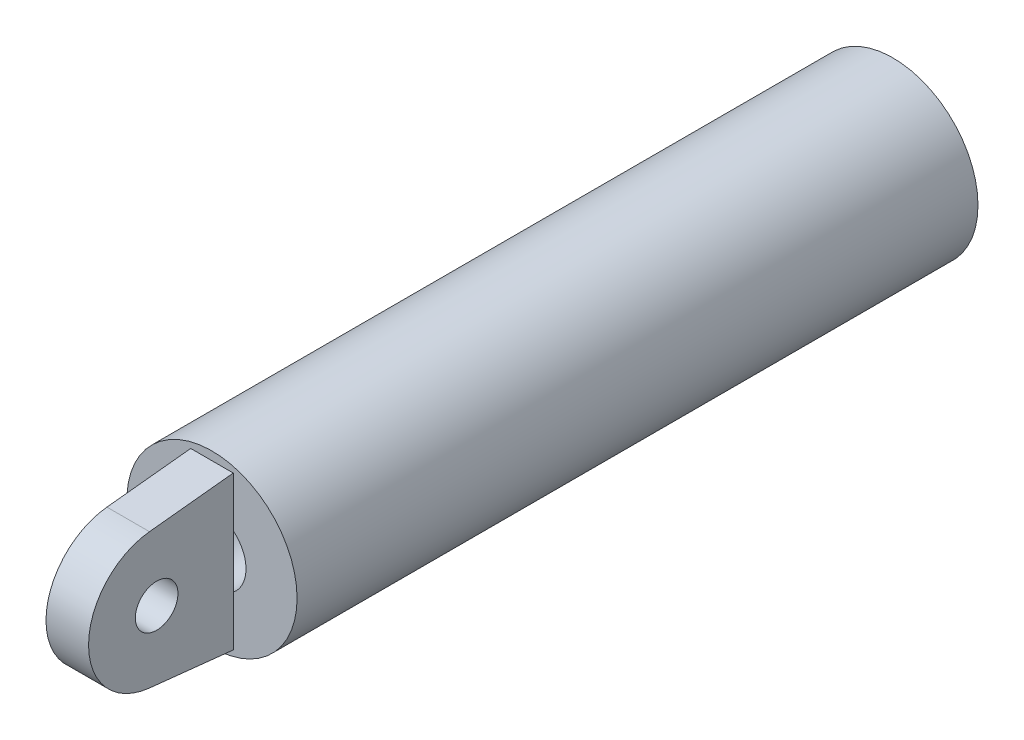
from build123d import *

# Parameters (mm, degrees)
SKETCH2_R                = 50
SKETCH2_R_2              = 20
BOSS_EXTRUDE1_DEPTH      = 400
BOSS_EXTRUDE2_DEPTH      = 12.5
BOSS_EXTRUDE2_DEPTH_BACK = 12.5
SKETCH3_R                = 12.5


with BuildPart() as part:
    # Sketch2 → Boss-Extrude1 (new body)
    with BuildSketch(Plane.XY):
        Circle(SKETCH2_R)
        Circle(SKETCH2_R_2, mode=Mode.SUBTRACT)
    extrude(amount=BOSS_EXTRUDE1_DEPTH)

    # Sketch3 → Boss-Extrude2 (add, two sides: drawn at the far end of the back side and taken through both)
    with BuildSketch(Plane(origin=(0, 0, 0), x_dir=(0, 0, -1), z_dir=(1, 0, 0)).offset(-BOSS_EXTRUDE2_DEPTH_BACK)):
        with BuildLine():
            Line((-400, 45), (-449.221099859, 39.776655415))
            ThreePointArc((-449.221099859, 39.776655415), (-485, 0), (-449.221099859, -39.776655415))
            Line((-449.221099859, -39.776655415), (-400, -45))
            Line((-400, -45), (-400, 45))
        make_face()
        with Locations((-445, 0)):
            Circle(SKETCH3_R, mode=Mode.SUBTRACT)
    extrude(amount=BOSS_EXTRUDE2_DEPTH + BOSS_EXTRUDE2_DEPTH_BACK)


solid = part.part
